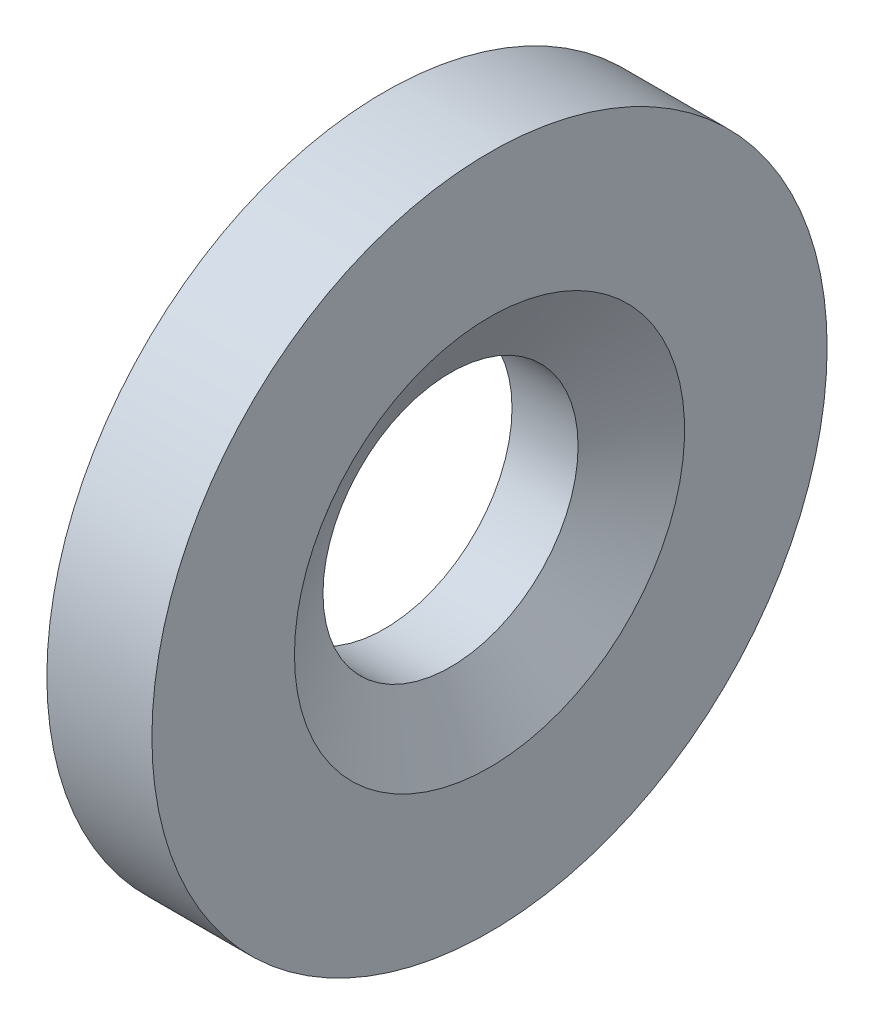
ISO-10303-21;
HEADER;
FILE_DESCRIPTION(('STEP AP214'),'2;1');
FILE_NAME('part.step','',(''),(''),'','','');
FILE_SCHEMA(('AUTOMOTIVE_DESIGN { 1 0 10303 214 1 1 1 1 }'));
ENDSEC;
DATA;
#1=APPLICATION_CONTEXT('core data for automotive mechanical design processes');
#2=APPLICATION_PROTOCOL_DEFINITION('international standard','automotive_design',2000,#1);
#3=PRODUCT_CONTEXT('',#1,'mechanical');
#4=PRODUCT('Part','Part','',(#3));
#5=PRODUCT_RELATED_PRODUCT_CATEGORY('part','',(#4));
#6=PRODUCT_DEFINITION_FORMATION('','',#4);
#7=PRODUCT_DEFINITION_CONTEXT('part definition',#1,'design');
#8=PRODUCT_DEFINITION('design','',#6,#7);
#9=PRODUCT_DEFINITION_SHAPE('','',#8);
#10=(LENGTH_UNIT() NAMED_UNIT(*) SI_UNIT(.MILLI.,.METRE.));
#11=(NAMED_UNIT(*) PLANE_ANGLE_UNIT() SI_UNIT($,.RADIAN.));
#12=(NAMED_UNIT(*) SI_UNIT($,.STERADIAN.) SOLID_ANGLE_UNIT());
#13=UNCERTAINTY_MEASURE_WITH_UNIT(LENGTH_MEASURE(1.E-05),#10,'distance_accuracy_value','');
#14=(GEOMETRIC_REPRESENTATION_CONTEXT(3) GLOBAL_UNCERTAINTY_ASSIGNED_CONTEXT((#13)) GLOBAL_UNIT_ASSIGNED_CONTEXT((#10,
#11,#12)) REPRESENTATION_CONTEXT('',''));
#15=CARTESIAN_POINT('',(0.,0.,0.));
#16=DIRECTION('',(0.,0.,1.));
#17=DIRECTION('',(1.,0.,0.));
#18=AXIS2_PLACEMENT_3D('',#15,#16,#17);
#19=CARTESIAN_POINT('',(-23.5478986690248,0.,0.));
#20=DIRECTION('',(-1.,0.,0.));
#21=DIRECTION('',(0.,0.,1.));
#22=AXIS2_PLACEMENT_3D('',#19,#20,#21);
#23=CYLINDRICAL_SURFACE('',#22,8.5);
#24=CARTESIAN_POINT('',(4.40192378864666,0.,0.));
#25=DIRECTION('',(-1.,0.,0.));
#26=DIRECTION('',(0.,0.,1.));
#27=AXIS2_PLACEMENT_3D('',#24,#25,#26);
#28=CIRCLE('',#27,8.5);
#29=CARTESIAN_POINT('',(4.40192378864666,0.,8.5));
#30=VERTEX_POINT('',#29);
#31=EDGE_CURVE('E49',#30,#30,#28,.T.);
#32=ORIENTED_EDGE('',*,*,#31,.F.);
#33=EDGE_LOOP('',(#32));
#34=FACE_BOUND('',#33,.T.);
#35=CARTESIAN_POINT('',(0.,0.,0.));
#36=DIRECTION('',(-1.,0.,0.));
#37=DIRECTION('',(0.,0.,1.));
#38=AXIS2_PLACEMENT_3D('',#35,#36,#37);
#39=CIRCLE('',#38,8.5);
#40=CARTESIAN_POINT('',(0.,0.,8.5));
#41=VERTEX_POINT('',#40);
#42=EDGE_CURVE('E10',#41,#41,#39,.T.);
#43=ORIENTED_EDGE('',*,*,#42,.T.);
#44=EDGE_LOOP('',(#43));
#45=FACE_BOUND('',#44,.T.);
#46=ADVANCED_FACE('F30',(#34,#45),#23,.F.);
#47=CARTESIAN_POINT('',(0.,8.5,0.));
#48=DIRECTION('',(1.,0.,0.));
#49=DIRECTION('',(0.,0.,-1.));
#50=AXIS2_PLACEMENT_3D('',#47,#48,#49);
#51=PLANE('',#50);
#52=ORIENTED_EDGE('',*,*,#42,.F.);
#53=EDGE_LOOP('',(#52));
#54=FACE_BOUND('',#53,.T.);
#55=CARTESIAN_POINT('',(0.,0.,0.));
#56=DIRECTION('',(-1.,0.,0.));
#57=DIRECTION('',(0.,0.,1.));
#58=AXIS2_PLACEMENT_3D('',#55,#56,#57);
#59=CIRCLE('',#58,22.5);
#60=CARTESIAN_POINT('',(0.,0.,22.5));
#61=VERTEX_POINT('',#60);
#62=EDGE_CURVE('E36',#61,#61,#59,.T.);
#63=ORIENTED_EDGE('',*,*,#62,.T.);
#64=EDGE_LOOP('',(#63));
#65=FACE_BOUND('',#64,.T.);
#66=ADVANCED_FACE('F56',(#54,#65),#51,.F.);
#67=CARTESIAN_POINT('',(-23.5478986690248,0.,0.));
#68=DIRECTION('',(-1.,0.,0.));
#69=DIRECTION('',(0.,0.,1.));
#70=AXIS2_PLACEMENT_3D('',#67,#68,#69);
#71=CYLINDRICAL_SURFACE('',#70,22.5);
#72=ORIENTED_EDGE('',*,*,#62,.F.);
#73=EDGE_LOOP('',(#72));
#74=FACE_BOUND('',#73,.T.);
#75=CARTESIAN_POINT('',(7.,0.,0.));
#76=DIRECTION('',(-1.,0.,0.));
#77=DIRECTION('',(0.,0.,1.));
#78=AXIS2_PLACEMENT_3D('',#75,#76,#77);
#79=CIRCLE('',#78,22.5);
#80=CARTESIAN_POINT('',(7.,0.,22.5));
#81=VERTEX_POINT('',#80);
#82=EDGE_CURVE('E40',#81,#81,#79,.T.);
#83=ORIENTED_EDGE('',*,*,#82,.T.);
#84=EDGE_LOOP('',(#83));
#85=FACE_BOUND('',#84,.T.);
#86=ADVANCED_FACE('F60',(#74,#85),#71,.T.);
#87=CARTESIAN_POINT('',(7.,22.5,0.));
#88=DIRECTION('',(-1.,0.,0.));
#89=DIRECTION('',(0.,0.,1.));
#90=AXIS2_PLACEMENT_3D('',#87,#88,#89);
#91=PLANE('',#90);
#92=ORIENTED_EDGE('',*,*,#82,.F.);
#93=EDGE_LOOP('',(#92));
#94=FACE_BOUND('',#93,.T.);
#95=CARTESIAN_POINT('',(7.,0.,0.));
#96=DIRECTION('',(-1.,0.,0.));
#97=DIRECTION('',(0.,0.,1.));
#98=AXIS2_PLACEMENT_3D('',#95,#96,#97);
#99=CIRCLE('',#98,13.);
#100=CARTESIAN_POINT('',(7.,0.,13.));
#101=VERTEX_POINT('',#100);
#102=EDGE_CURVE('E44',#101,#101,#99,.T.);
#103=ORIENTED_EDGE('',*,*,#102,.T.);
#104=EDGE_LOOP('',(#103));
#105=FACE_BOUND('',#104,.T.);
#106=ADVANCED_FACE('F65',(#94,#105),#91,.F.);
#107=CARTESIAN_POINT('',(4.40192378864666,0.,0.));
#108=DIRECTION('',(1.,0.,0.));
#109=DIRECTION('',(0.,0.,-1.));
#110=AXIS2_PLACEMENT_3D('',#107,#108,#109);
#111=CONICAL_SURFACE('',#110,8.5,1.04719755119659);
#112=ORIENTED_EDGE('',*,*,#102,.F.);
#113=EDGE_LOOP('',(#112));
#114=FACE_BOUND('',#113,.T.);
#115=ORIENTED_EDGE('',*,*,#31,.T.);
#116=EDGE_LOOP('',(#115));
#117=FACE_BOUND('',#116,.T.);
#118=ADVANCED_FACE('F53',(#114,#117),#111,.F.);
#119=CLOSED_SHELL('',(#46,#66,#86,#106,#118));
#120=MANIFOLD_SOLID_BREP('B2',#119);
#121=ADVANCED_BREP_SHAPE_REPRESENTATION('',(#18,#120),#14);
#122=SHAPE_DEFINITION_REPRESENTATION(#9,#121);
ENDSEC;
END-ISO-10303-21;
